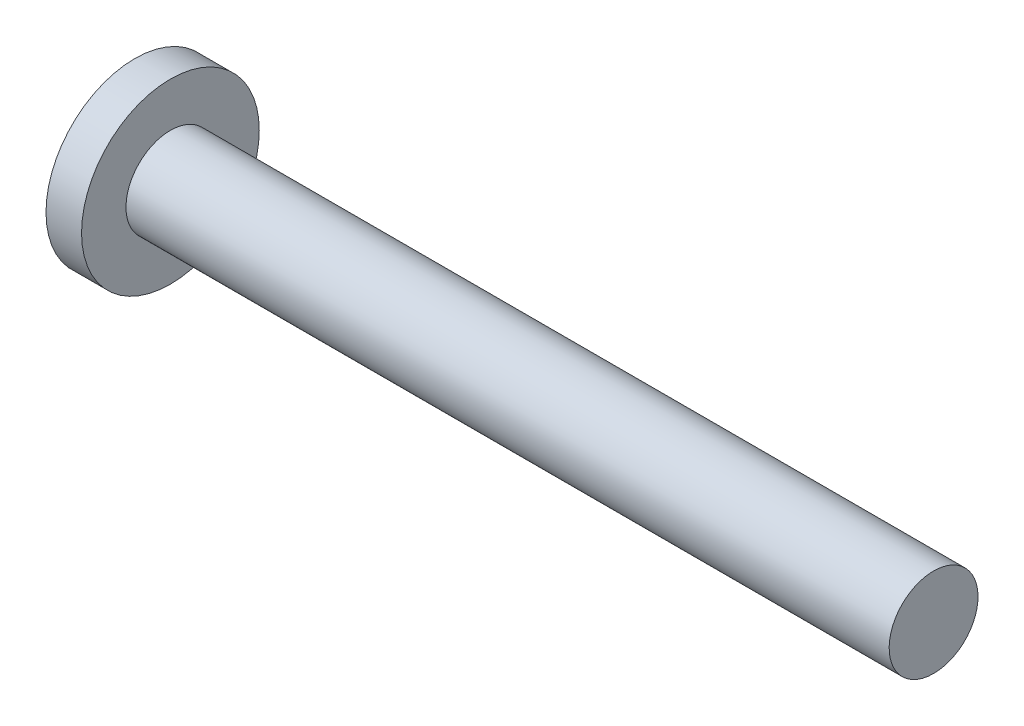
from build123d import *


with BuildPart() as part:
    # Sketch1 → Revolve1 (revolve)
    with BuildSketch(Plane.XY, mode=Mode.PRIVATE) as revolve1_sk:
        Polygon((0, 0), (0, 3.3909), (1.35636, 3.3909), (1.35636, 1.69545), (30.48, 1.69545), (30.48, 0), align=None)
    revolve(revolve1_sk.sketch.rotate(Axis((30.48, 0, 0), (-1, 0, 0)), 180), axis=Axis((30.48, 0, 0), (-1, 0, 0)))


solid = part.part
